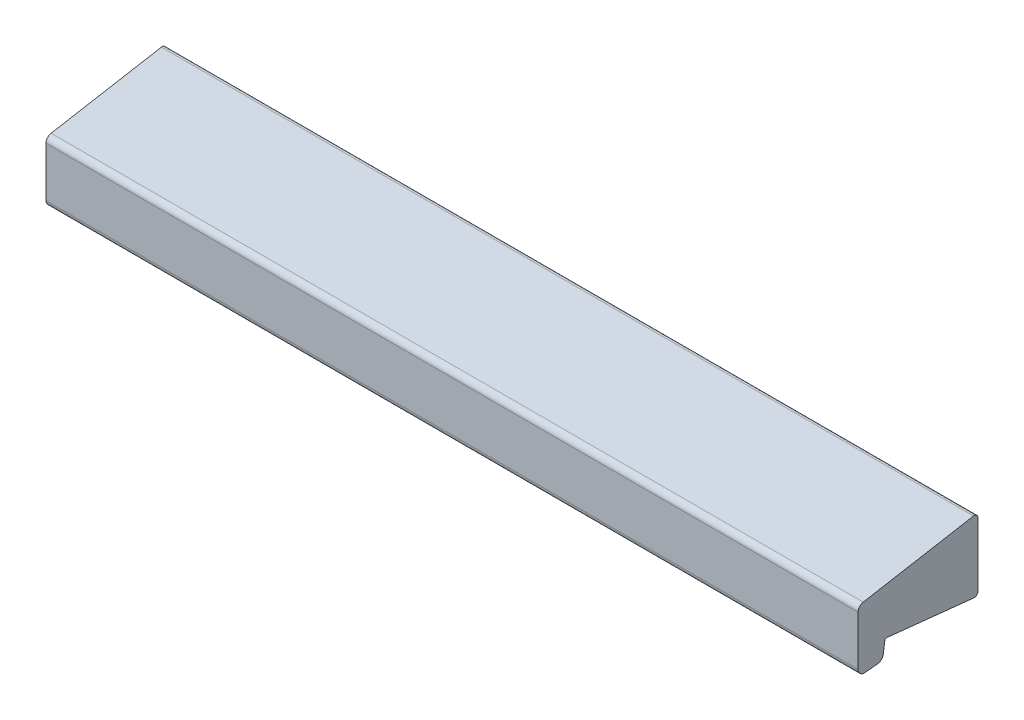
ISO-10303-21;
HEADER;
FILE_DESCRIPTION(('STEP AP214'),'2;1');
FILE_NAME('part.step','',(''),(''),'','','');
FILE_SCHEMA(('AUTOMOTIVE_DESIGN { 1 0 10303 214 1 1 1 1 }'));
ENDSEC;
DATA;
#1=APPLICATION_CONTEXT('core data for automotive mechanical design processes');
#2=APPLICATION_PROTOCOL_DEFINITION('international standard','automotive_design',2000,#1);
#3=PRODUCT_CONTEXT('',#1,'mechanical');
#4=PRODUCT('Part','Part','',(#3));
#5=PRODUCT_RELATED_PRODUCT_CATEGORY('part','',(#4));
#6=PRODUCT_DEFINITION_FORMATION('','',#4);
#7=PRODUCT_DEFINITION_CONTEXT('part definition',#1,'design');
#8=PRODUCT_DEFINITION('design','',#6,#7);
#9=PRODUCT_DEFINITION_SHAPE('','',#8);
#10=(LENGTH_UNIT() NAMED_UNIT(*) SI_UNIT(.MILLI.,.METRE.));
#11=(NAMED_UNIT(*) PLANE_ANGLE_UNIT() SI_UNIT($,.RADIAN.));
#12=(NAMED_UNIT(*) SI_UNIT($,.STERADIAN.) SOLID_ANGLE_UNIT());
#13=UNCERTAINTY_MEASURE_WITH_UNIT(LENGTH_MEASURE(1.E-05),#10,'distance_accuracy_value','');
#14=(GEOMETRIC_REPRESENTATION_CONTEXT(3) GLOBAL_UNCERTAINTY_ASSIGNED_CONTEXT((#13)) GLOBAL_UNIT_ASSIGNED_CONTEXT((#10,
#11,#12)) REPRESENTATION_CONTEXT('',''));
#15=CARTESIAN_POINT('',(0.,0.,0.));
#16=DIRECTION('',(0.,0.,1.));
#17=DIRECTION('',(1.,0.,0.));
#18=AXIS2_PLACEMENT_3D('',#15,#16,#17);
#19=CARTESIAN_POINT('',(-7.5,-4.1,0.5));
#20=DIRECTION('',(1.,0.,0.));
#21=DIRECTION('',(0.,0.,-1.));
#22=AXIS2_PLACEMENT_3D('',#19,#20,#21);
#23=CYLINDRICAL_SURFACE('',#22,0.5);
#24=DIRECTION('',(1.,0.,0.));
#25=VECTOR('',#24,1.);
#26=CARTESIAN_POINT('',(-7.5,-4.1,0.));
#27=LINE('',#26,#25);
#28=CARTESIAN_POINT('',(-7.5,-4.1,0.));
#29=VERTEX_POINT('',#28);
#30=CARTESIAN_POINT('',(97.5,-4.1,0.));
#31=VERTEX_POINT('',#30);
#32=EDGE_CURVE('E17',#29,#31,#27,.T.);
#33=ORIENTED_EDGE('',*,*,#32,.T.);
#34=CARTESIAN_POINT('',(97.5,-4.1,0.5));
#35=DIRECTION('',(1.,0.,0.));
#36=DIRECTION('',(0.,0.,-1.));
#37=AXIS2_PLACEMENT_3D('',#34,#35,#36);
#38=CIRCLE('',#37,0.5);
#39=CARTESIAN_POINT('',(97.5,-4.59726094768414,0.552264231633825));
#40=VERTEX_POINT('',#39);
#41=EDGE_CURVE('E102',#40,#31,#38,.T.);
#42=ORIENTED_EDGE('',*,*,#41,.F.);
#43=DIRECTION('',(1.,0.,0.));
#44=VECTOR('',#43,1.);
#45=CARTESIAN_POINT('',(-7.5,-4.59726094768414,0.552264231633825));
#46=LINE('',#45,#44);
#47=CARTESIAN_POINT('',(-7.5,-4.59726094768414,0.552264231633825));
#48=VERTEX_POINT('',#47);
#49=EDGE_CURVE('E9',#48,#40,#46,.T.);
#50=ORIENTED_EDGE('',*,*,#49,.F.);
#51=CARTESIAN_POINT('',(-7.5,-4.1,0.5));
#52=DIRECTION('',(1.,0.,0.));
#53=DIRECTION('',(0.,0.,1.));
#54=AXIS2_PLACEMENT_3D('',#51,#52,#53);
#55=CIRCLE('',#54,0.5);
#56=EDGE_CURVE('E103',#48,#29,#55,.T.);
#57=ORIENTED_EDGE('',*,*,#56,.T.);
#58=EDGE_LOOP('',(#33,#42,#50,#57));
#59=FACE_BOUND('',#58,.T.);
#60=ADVANCED_FACE('F14',(#59),#23,.T.);
#61=CARTESIAN_POINT('',(-7.5,-4.59726094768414,0.552264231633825));
#62=DIRECTION('',(0.,-0.994521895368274,0.10452846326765));
#63=DIRECTION('',(0.,-0.10452846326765,-0.994521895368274));
#64=AXIS2_PLACEMENT_3D('',#61,#62,#63);
#65=PLANE('',#64);
#66=ORIENTED_EDGE('',*,*,#49,.T.);
#67=DIRECTION('',(0.,-0.10452846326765,-0.994521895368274));
#68=VECTOR('',#67,1.);
#69=CARTESIAN_POINT('',(97.5,-3.41281418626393,11.8215223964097));
#70=LINE('',#69,#68);
#71=CARTESIAN_POINT('',(97.5,-3.41281418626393,11.8215223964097));
#72=VERTEX_POINT('',#71);
#73=EDGE_CURVE('E120',#72,#40,#70,.T.);
#74=ORIENTED_EDGE('',*,*,#73,.F.);
#75=DIRECTION('',(1.,0.,0.));
#76=VECTOR('',#75,1.);
#77=CARTESIAN_POINT('',(-7.5,-3.41281418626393,11.8215223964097));
#78=LINE('',#77,#76);
#79=CARTESIAN_POINT('',(-7.5,-3.41281418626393,11.8215223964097));
#80=VERTEX_POINT('',#79);
#81=EDGE_CURVE('E22',#80,#72,#78,.T.);
#82=ORIENTED_EDGE('',*,*,#81,.F.);
#83=DIRECTION('',(0.,-0.10452846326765,-0.994521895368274));
#84=VECTOR('',#83,1.);
#85=CARTESIAN_POINT('',(-7.5,-4.59726094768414,0.552264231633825));
#86=LINE('',#85,#84);
#87=EDGE_CURVE('E108',#80,#48,#86,.T.);
#88=ORIENTED_EDGE('',*,*,#87,.T.);
#89=EDGE_LOOP('',(#66,#74,#82,#88));
#90=FACE_BOUND('',#89,.T.);
#91=ADVANCED_FACE('F239',(#90),#65,.T.);
#92=CARTESIAN_POINT('',(-7.5,-3.61171856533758,11.8424280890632));
#93=DIRECTION('',(1.,0.,0.));
#94=DIRECTION('',(0.,0.,-1.));
#95=AXIS2_PLACEMENT_3D('',#92,#93,#94);
#96=CYLINDRICAL_SURFACE('',#95,0.2);
#97=ORIENTED_EDGE('',*,*,#81,.T.);
#98=CARTESIAN_POINT('',(97.5,-3.61171856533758,11.8424280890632));
#99=DIRECTION('',(-1.,0.,0.));
#100=DIRECTION('',(0.,0.,-1.));
#101=AXIS2_PLACEMENT_3D('',#98,#99,#100);
#102=CIRCLE('',#101,0.199999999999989);
#103=CARTESIAN_POINT('',(97.5,-3.58388394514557,12.0404817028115));
#104=VERTEX_POINT('',#103);
#105=EDGE_CURVE('E152',#104,#72,#102,.T.);
#106=ORIENTED_EDGE('',*,*,#105,.F.);
#107=DIRECTION('',(1.,0.,0.));
#108=VECTOR('',#107,1.);
#109=CARTESIAN_POINT('',(-7.5,-3.58388394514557,12.0404817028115));
#110=LINE('',#109,#108);
#111=CARTESIAN_POINT('',(-7.5,-3.58388394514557,12.0404817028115));
#112=VERTEX_POINT('',#111);
#113=EDGE_CURVE('E186',#112,#104,#110,.T.);
#114=ORIENTED_EDGE('',*,*,#113,.F.);
#115=CARTESIAN_POINT('',(-7.5,-3.61171856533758,11.8424280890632));
#116=DIRECTION('',(-1.,0.,0.));
#117=DIRECTION('',(0.,0.,1.));
#118=AXIS2_PLACEMENT_3D('',#115,#116,#117);
#119=CIRCLE('',#118,0.2);
#120=EDGE_CURVE('E182',#112,#80,#119,.T.);
#121=ORIENTED_EDGE('',*,*,#120,.T.);
#122=EDGE_LOOP('',(#97,#106,#114,#121));
#123=FACE_BOUND('',#122,.T.);
#124=ADVANCED_FACE('F237',(#123),#96,.F.);
#125=CARTESIAN_POINT('',(-7.5,-3.58388394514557,12.0404817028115));
#126=DIRECTION('',(0.,-0.139173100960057,-0.990268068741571));
#127=DIRECTION('',(0.,0.990268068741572,-0.139173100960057));
#128=AXIS2_PLACEMENT_3D('',#125,#126,#127);
#129=PLANE('',#128);
#130=ORIENTED_EDGE('',*,*,#113,.T.);
#131=DIRECTION('',(0.,0.99026806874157,-0.139173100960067));
#132=VECTOR('',#131,1.);
#133=CARTESIAN_POINT('',(97.5,-5.0807720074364,12.2508556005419));
#134=LINE('',#133,#132);
#135=CARTESIAN_POINT('',(97.5,-5.0807720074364,12.2508556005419));
#136=VERTEX_POINT('',#135);
#137=EDGE_CURVE('E149',#136,#104,#134,.T.);
#138=ORIENTED_EDGE('',*,*,#137,.F.);
#139=DIRECTION('',(1.,0.,0.));
#140=VECTOR('',#139,1.);
#141=CARTESIAN_POINT('',(-7.5,-5.0807720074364,12.2508556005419));
#142=LINE('',#141,#140);
#143=CARTESIAN_POINT('',(-7.5,-5.0807720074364,12.2508556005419));
#144=VERTEX_POINT('',#143);
#145=EDGE_CURVE('E188',#144,#136,#142,.T.);
#146=ORIENTED_EDGE('',*,*,#145,.F.);
#147=DIRECTION('',(0.,0.990268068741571,-0.139173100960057));
#148=VECTOR('',#147,1.);
#149=CARTESIAN_POINT('',(-7.5,-3.58388394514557,12.0404817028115));
#150=LINE('',#149,#148);
#151=EDGE_CURVE('E179',#144,#112,#150,.T.);
#152=ORIENTED_EDGE('',*,*,#151,.T.);
#153=EDGE_LOOP('',(#130,#138,#146,#152));
#154=FACE_BOUND('',#153,.T.);
#155=ADVANCED_FACE('F235',(#154),#129,.T.);
#156=CARTESIAN_POINT('',(-7.5,-4.96943352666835,13.0430700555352));
#157=DIRECTION('',(1.,0.,0.));
#158=DIRECTION('',(0.,0.,-1.));
#159=AXIS2_PLACEMENT_3D('',#156,#157,#158);
#160=CYLINDRICAL_SURFACE('',#159,0.8);
#161=ORIENTED_EDGE('',*,*,#145,.T.);
#162=CARTESIAN_POINT('',(97.5,-4.96943352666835,13.0430700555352));
#163=DIRECTION('',(1.,0.,0.));
#164=DIRECTION('',(0.,0.,-1.));
#165=AXIS2_PLACEMENT_3D('',#162,#163,#164);
#166=CIRCLE('',#165,0.8);
#167=CARTESIAN_POINT('',(97.5,-5.76597138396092,12.9687232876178));
#168=VERTEX_POINT('',#167);
#169=EDGE_CURVE('E146',#168,#136,#166,.T.);
#170=ORIENTED_EDGE('',*,*,#169,.F.);
#171=DIRECTION('',(1.,0.,0.));
#172=VECTOR('',#171,1.);
#173=CARTESIAN_POINT('',(-7.5,-5.76597138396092,12.9687232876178));
#174=LINE('',#173,#172);
#175=CARTESIAN_POINT('',(-7.5,-5.76597138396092,12.9687232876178));
#176=VERTEX_POINT('',#175);
#177=EDGE_CURVE('E190',#176,#168,#174,.T.);
#178=ORIENTED_EDGE('',*,*,#177,.F.);
#179=CARTESIAN_POINT('',(-7.5,-4.96943352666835,13.0430700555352));
#180=DIRECTION('',(1.,0.,0.));
#181=DIRECTION('',(0.,0.,1.));
#182=AXIS2_PLACEMENT_3D('',#179,#180,#181);
#183=CIRCLE('',#182,0.8);
#184=EDGE_CURVE('E176',#176,#144,#183,.T.);
#185=ORIENTED_EDGE('',*,*,#184,.T.);
#186=EDGE_LOOP('',(#161,#170,#178,#185));
#187=FACE_BOUND('',#186,.T.);
#188=ADVANCED_FACE('F230',(#187),#160,.T.);
#189=CARTESIAN_POINT('',(-7.5,-5.76597138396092,12.9687232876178));
#190=DIRECTION('',(0.,-0.995672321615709,-0.0929334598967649));
#191=DIRECTION('',(0.,0.0929334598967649,-0.995672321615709));
#192=AXIS2_PLACEMENT_3D('',#189,#190,#191);
#193=PLANE('',#192);
#194=ORIENTED_EDGE('',*,*,#177,.T.);
#195=DIRECTION('',(0.,0.0929334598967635,-0.995672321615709));
#196=VECTOR('',#195,1.);
#197=CARTESIAN_POINT('',(97.5,-5.92062490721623,14.6256532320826));
#198=LINE('',#197,#196);
#199=CARTESIAN_POINT('',(97.5,-5.92062490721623,14.6256532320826));
#200=VERTEX_POINT('',#199);
#201=EDGE_CURVE('E143',#200,#168,#198,.T.);
#202=ORIENTED_EDGE('',*,*,#201,.F.);
#203=DIRECTION('',(1.,0.,0.));
#204=VECTOR('',#203,1.);
#205=CARTESIAN_POINT('',(-7.5,-5.92062490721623,14.6256532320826));
#206=LINE('',#205,#204);
#207=CARTESIAN_POINT('',(-7.5,-5.92062490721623,14.6256532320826));
#208=VERTEX_POINT('',#207);
#209=EDGE_CURVE('E192',#208,#200,#206,.T.);
#210=ORIENTED_EDGE('',*,*,#209,.F.);
#211=DIRECTION('',(0.,0.0929334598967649,-0.995672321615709));
#212=VECTOR('',#211,1.);
#213=CARTESIAN_POINT('',(-7.5,-5.76597138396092,12.9687232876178));
#214=LINE('',#213,#212);
#215=EDGE_CURVE('E173',#208,#176,#214,.T.);
#216=ORIENTED_EDGE('',*,*,#215,.T.);
#217=EDGE_LOOP('',(#194,#202,#210,#216));
#218=FACE_BOUND('',#217,.T.);
#219=ADVANCED_FACE('F225',(#218),#193,.T.);
#220=CARTESIAN_POINT('',(-7.5,-5.12408704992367,14.7));
#221=DIRECTION('',(1.,0.,0.));
#222=DIRECTION('',(0.,0.,-1.));
#223=AXIS2_PLACEMENT_3D('',#220,#221,#222);
#224=CYLINDRICAL_SURFACE('',#223,0.8);
#225=ORIENTED_EDGE('',*,*,#209,.T.);
#226=CARTESIAN_POINT('',(97.5,-5.12408704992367,14.7));
#227=DIRECTION('',(1.,0.,0.));
#228=DIRECTION('',(0.,0.,-1.));
#229=AXIS2_PLACEMENT_3D('',#226,#227,#228);
#230=CIRCLE('',#229,0.8);
#231=CARTESIAN_POINT('',(97.5,-5.12408704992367,15.5));
#232=VERTEX_POINT('',#231);
#233=EDGE_CURVE('E140',#232,#200,#230,.T.);
#234=ORIENTED_EDGE('',*,*,#233,.F.);
#235=DIRECTION('',(1.,0.,0.));
#236=VECTOR('',#235,1.);
#237=CARTESIAN_POINT('',(-7.5,-5.12408704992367,15.5));
#238=LINE('',#237,#236);
#239=CARTESIAN_POINT('',(-7.5,-5.12408704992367,15.5));
#240=VERTEX_POINT('',#239);
#241=EDGE_CURVE('E194',#240,#232,#238,.T.);
#242=ORIENTED_EDGE('',*,*,#241,.F.);
#243=CARTESIAN_POINT('',(-7.5,-5.12408704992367,14.7));
#244=DIRECTION('',(1.,0.,0.));
#245=DIRECTION('',(0.,0.,-1.));
#246=AXIS2_PLACEMENT_3D('',#243,#244,#245);
#247=CIRCLE('',#246,0.8);
#248=EDGE_CURVE('E170',#240,#208,#247,.T.);
#249=ORIENTED_EDGE('',*,*,#248,.T.);
#250=EDGE_LOOP('',(#225,#234,#242,#249));
#251=FACE_BOUND('',#250,.T.);
#252=ADVANCED_FACE('F223',(#251),#224,.T.);
#253=CARTESIAN_POINT('',(-7.5,-5.12408704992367,15.5));
#254=DIRECTION('',(0.,0.,1.));
#255=DIRECTION('',(0.,-1.,0.));
#256=AXIS2_PLACEMENT_3D('',#253,#254,#255);
#257=PLANE('',#256);
#258=ORIENTED_EDGE('',*,*,#241,.T.);
#259=DIRECTION('',(0.,-1.,0.));
#260=VECTOR('',#259,1.);
#261=CARTESIAN_POINT('',(97.5,1.291528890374,15.5));
#262=LINE('',#261,#260);
#263=CARTESIAN_POINT('',(97.5,1.291528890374,15.5));
#264=VERTEX_POINT('',#263);
#265=EDGE_CURVE('E137',#264,#232,#262,.T.);
#266=ORIENTED_EDGE('',*,*,#265,.F.);
#267=DIRECTION('',(1.,0.,0.));
#268=VECTOR('',#267,1.);
#269=CARTESIAN_POINT('',(-7.5,1.291528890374,15.5));
#270=LINE('',#269,#268);
#271=CARTESIAN_POINT('',(-7.5,1.291528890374,15.5));
#272=VERTEX_POINT('',#271);
#273=EDGE_CURVE('E196',#272,#264,#270,.T.);
#274=ORIENTED_EDGE('',*,*,#273,.F.);
#275=DIRECTION('',(0.,-1.,0.));
#276=VECTOR('',#275,1.);
#277=CARTESIAN_POINT('',(-7.5,-5.12408704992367,15.5));
#278=LINE('',#277,#276);
#279=EDGE_CURVE('E167',#272,#240,#278,.T.);
#280=ORIENTED_EDGE('',*,*,#279,.T.);
#281=EDGE_LOOP('',(#258,#266,#274,#280));
#282=FACE_BOUND('',#281,.T.);
#283=ADVANCED_FACE('F218',(#282),#257,.T.);
#284=CARTESIAN_POINT('',(-7.5,1.291528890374,14.7));
#285=DIRECTION('',(1.,0.,0.));
#286=DIRECTION('',(0.,0.,-1.));
#287=AXIS2_PLACEMENT_3D('',#284,#285,#286);
#288=CYLINDRICAL_SURFACE('',#287,0.8);
#289=ORIENTED_EDGE('',*,*,#273,.T.);
#290=CARTESIAN_POINT('',(97.5,1.291528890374,14.7));
#291=DIRECTION('',(1.,0.,0.));
#292=DIRECTION('',(0.,0.,-1.));
#293=AXIS2_PLACEMENT_3D('',#290,#291,#292);
#294=CIRCLE('',#293,0.8);
#295=CARTESIAN_POINT('',(97.5,2.07937509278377,14.8389185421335));
#296=VERTEX_POINT('',#295);
#297=EDGE_CURVE('E134',#296,#264,#294,.T.);
#298=ORIENTED_EDGE('',*,*,#297,.F.);
#299=DIRECTION('',(1.,0.,0.));
#300=VECTOR('',#299,1.);
#301=CARTESIAN_POINT('',(-7.5,2.07937509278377,14.8389185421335));
#302=LINE('',#301,#300);
#303=CARTESIAN_POINT('',(-7.5,2.07937509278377,14.8389185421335));
#304=VERTEX_POINT('',#303);
#305=EDGE_CURVE('E198',#304,#296,#302,.T.);
#306=ORIENTED_EDGE('',*,*,#305,.F.);
#307=CARTESIAN_POINT('',(-7.5,1.291528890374,14.7));
#308=DIRECTION('',(1.,0.,0.));
#309=DIRECTION('',(0.,0.,1.));
#310=AXIS2_PLACEMENT_3D('',#307,#308,#309);
#311=CIRCLE('',#310,0.8);
#312=EDGE_CURVE('E164',#304,#272,#311,.T.);
#313=ORIENTED_EDGE('',*,*,#312,.T.);
#314=EDGE_LOOP('',(#289,#298,#306,#313));
#315=FACE_BOUND('',#314,.T.);
#316=ADVANCED_FACE('F211',(#315),#288,.T.);
#317=CARTESIAN_POINT('',(-7.5,4.5924038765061,0.586824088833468));
#318=DIRECTION('',(0.,0.984807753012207,0.173648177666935));
#319=DIRECTION('',(0.,-0.173648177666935,0.984807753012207));
#320=AXIS2_PLACEMENT_3D('',#317,#318,#319);
#321=PLANE('',#320);
#322=ORIENTED_EDGE('',*,*,#305,.T.);
#323=DIRECTION('',(0.,-0.173648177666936,0.984807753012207));
#324=VECTOR('',#323,1.);
#325=CARTESIAN_POINT('',(97.5,4.5924038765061,0.586824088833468));
#326=LINE('',#325,#324);
#327=CARTESIAN_POINT('',(97.5,4.5924038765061,0.586824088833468));
#328=VERTEX_POINT('',#327);
#329=EDGE_CURVE('E131',#328,#296,#326,.T.);
#330=ORIENTED_EDGE('',*,*,#329,.F.);
#331=DIRECTION('',(1.,0.,0.));
#332=VECTOR('',#331,1.);
#333=CARTESIAN_POINT('',(-7.5,4.5924038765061,0.586824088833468));
#334=LINE('',#333,#332);
#335=CARTESIAN_POINT('',(-7.5,4.5924038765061,0.586824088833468));
#336=VERTEX_POINT('',#335);
#337=EDGE_CURVE('E200',#336,#328,#334,.T.);
#338=ORIENTED_EDGE('',*,*,#337,.F.);
#339=DIRECTION('',(0.,-0.173648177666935,0.984807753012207));
#340=VECTOR('',#339,1.);
#341=CARTESIAN_POINT('',(-7.5,4.5924038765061,0.586824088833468));
#342=LINE('',#341,#340);
#343=EDGE_CURVE('E161',#336,#304,#342,.T.);
#344=ORIENTED_EDGE('',*,*,#343,.T.);
#345=EDGE_LOOP('',(#322,#330,#338,#344));
#346=FACE_BOUND('',#345,.T.);
#347=ADVANCED_FACE('F208',(#346),#321,.T.);
#348=CARTESIAN_POINT('',(-7.5,4.1,0.5));
#349=DIRECTION('',(1.,0.,0.));
#350=DIRECTION('',(0.,0.,-1.));
#351=AXIS2_PLACEMENT_3D('',#348,#349,#350);
#352=CYLINDRICAL_SURFACE('',#351,0.5);
#353=ORIENTED_EDGE('',*,*,#337,.T.);
#354=CARTESIAN_POINT('',(97.5,4.1,0.5));
#355=DIRECTION('',(1.,0.,0.));
#356=DIRECTION('',(0.,0.,-1.));
#357=AXIS2_PLACEMENT_3D('',#354,#355,#356);
#358=CIRCLE('',#357,0.5);
#359=CARTESIAN_POINT('',(97.5,4.1,0.));
#360=VERTEX_POINT('',#359);
#361=EDGE_CURVE('E115',#360,#328,#358,.T.);
#362=ORIENTED_EDGE('',*,*,#361,.F.);
#363=DIRECTION('',(1.,0.,0.));
#364=VECTOR('',#363,1.);
#365=CARTESIAN_POINT('',(-7.5,4.1,0.));
#366=LINE('',#365,#364);
#367=CARTESIAN_POINT('',(-7.5,4.1,0.));
#368=VERTEX_POINT('',#367);
#369=EDGE_CURVE('E107',#368,#360,#366,.T.);
#370=ORIENTED_EDGE('',*,*,#369,.F.);
#371=CARTESIAN_POINT('',(-7.5,4.1,0.5));
#372=DIRECTION('',(1.,0.,0.));
#373=DIRECTION('',(0.,0.,1.));
#374=AXIS2_PLACEMENT_3D('',#371,#372,#373);
#375=CIRCLE('',#374,0.5);
#376=EDGE_CURVE('E158',#368,#336,#375,.T.);
#377=ORIENTED_EDGE('',*,*,#376,.T.);
#378=EDGE_LOOP('',(#353,#362,#370,#377));
#379=FACE_BOUND('',#378,.T.);
#380=ADVANCED_FACE('F202',(#379),#352,.T.);
#381=CARTESIAN_POINT('',(-7.5,-4.1,0.));
#382=DIRECTION('',(0.,0.,-1.));
#383=DIRECTION('',(-1.,0.,0.));
#384=AXIS2_PLACEMENT_3D('',#381,#382,#383);
#385=PLANE('',#384);
#386=CARTESIAN_POINT('',(0.,0.,0.));
#387=DIRECTION('',(0.,0.,-1.));
#388=DIRECTION('',(-1.,0.,0.));
#389=AXIS2_PLACEMENT_3D('',#386,#387,#388);
#390=CIRCLE('',#389,2.);
#391=CARTESIAN_POINT('',(-2.,0.,0.));
#392=VERTEX_POINT('',#391);
#393=EDGE_CURVE('E124',#392,#392,#390,.T.);
#394=ORIENTED_EDGE('',*,*,#393,.F.);
#395=EDGE_LOOP('',(#394));
#396=FACE_BOUND('',#395,.T.);
#397=CARTESIAN_POINT('',(90.,0.,0.));
#398=DIRECTION('',(0.,0.,-1.));
#399=DIRECTION('',(-1.,0.,0.));
#400=AXIS2_PLACEMENT_3D('',#397,#398,#399);
#401=CIRCLE('',#400,2.);
#402=CARTESIAN_POINT('',(88.,0.,0.));
#403=VERTEX_POINT('',#402);
#404=EDGE_CURVE('E127',#403,#403,#401,.T.);
#405=ORIENTED_EDGE('',*,*,#404,.F.);
#406=EDGE_LOOP('',(#405));
#407=FACE_BOUND('',#406,.T.);
#408=ORIENTED_EDGE('',*,*,#369,.T.);
#409=DIRECTION('',(0.,1.,0.));
#410=VECTOR('',#409,1.);
#411=CARTESIAN_POINT('',(97.5,-4.1,0.));
#412=LINE('',#411,#410);
#413=EDGE_CURVE('E110',#31,#360,#412,.T.);
#414=ORIENTED_EDGE('',*,*,#413,.F.);
#415=ORIENTED_EDGE('',*,*,#32,.F.);
#416=DIRECTION('',(0.,1.,0.));
#417=VECTOR('',#416,1.);
#418=CARTESIAN_POINT('',(-7.5,-4.1,0.));
#419=LINE('',#418,#417);
#420=EDGE_CURVE('E156',#29,#368,#419,.T.);
#421=ORIENTED_EDGE('',*,*,#420,.T.);
#422=EDGE_LOOP('',(#408,#414,#415,#421));
#423=FACE_BOUND('',#422,.T.);
#424=ADVANCED_FACE('F111',(#396,#407,#423),#385,.T.);
#425=CARTESIAN_POINT('',(-7.5,-4.1,0.5));
#426=DIRECTION('',(-1.,0.,0.));
#427=DIRECTION('',(0.,0.,1.));
#428=AXIS2_PLACEMENT_3D('',#425,#426,#427);
#429=PLANE('',#428);
#430=ORIENTED_EDGE('',*,*,#56,.F.);
#431=ORIENTED_EDGE('',*,*,#87,.F.);
#432=ORIENTED_EDGE('',*,*,#120,.F.);
#433=ORIENTED_EDGE('',*,*,#151,.F.);
#434=ORIENTED_EDGE('',*,*,#184,.F.);
#435=ORIENTED_EDGE('',*,*,#215,.F.);
#436=ORIENTED_EDGE('',*,*,#248,.F.);
#437=ORIENTED_EDGE('',*,*,#279,.F.);
#438=ORIENTED_EDGE('',*,*,#312,.F.);
#439=ORIENTED_EDGE('',*,*,#343,.F.);
#440=ORIENTED_EDGE('',*,*,#376,.F.);
#441=ORIENTED_EDGE('',*,*,#420,.F.);
#442=EDGE_LOOP('',(#430,#431,#432,#433,#434,#435,#436,#437,#438,#439,#440,#441));
#443=FACE_BOUND('',#442,.T.);
#444=ADVANCED_FACE('F214',(#443),#429,.T.);
#445=CARTESIAN_POINT('',(97.5,-4.1,0.5));
#446=DIRECTION('',(1.,0.,0.));
#447=DIRECTION('',(0.,0.,-1.));
#448=AXIS2_PLACEMENT_3D('',#445,#446,#447);
#449=PLANE('',#448);
#450=ORIENTED_EDGE('',*,*,#41,.T.);
#451=ORIENTED_EDGE('',*,*,#413,.T.);
#452=ORIENTED_EDGE('',*,*,#361,.T.);
#453=ORIENTED_EDGE('',*,*,#329,.T.);
#454=ORIENTED_EDGE('',*,*,#297,.T.);
#455=ORIENTED_EDGE('',*,*,#265,.T.);
#456=ORIENTED_EDGE('',*,*,#233,.T.);
#457=ORIENTED_EDGE('',*,*,#201,.T.);
#458=ORIENTED_EDGE('',*,*,#169,.T.);
#459=ORIENTED_EDGE('',*,*,#137,.T.);
#460=ORIENTED_EDGE('',*,*,#105,.T.);
#461=ORIENTED_EDGE('',*,*,#73,.T.);
#462=EDGE_LOOP('',(#450,#451,#452,#453,#454,#455,#456,#457,#458,#459,#460,#461));
#463=FACE_BOUND('',#462,.T.);
#464=ADVANCED_FACE('F118',(#463),#449,.T.);
#465=CARTESIAN_POINT('',(90.,0.,8.));
#466=DIRECTION('',(0.,0.,-1.));
#467=DIRECTION('',(-1.,0.,0.));
#468=AXIS2_PLACEMENT_3D('',#465,#466,#467);
#469=CYLINDRICAL_SURFACE('',#468,2.);
#470=CARTESIAN_POINT('',(90.,0.,8.));
#471=DIRECTION('',(0.,0.,-1.));
#472=DIRECTION('',(-1.,0.,0.));
#473=AXIS2_PLACEMENT_3D('',#470,#471,#472);
#474=CIRCLE('',#473,2.);
#475=CARTESIAN_POINT('',(88.,0.,8.));
#476=VERTEX_POINT('',#475);
#477=EDGE_CURVE('E279',#476,#476,#474,.T.);
#478=ORIENTED_EDGE('',*,*,#477,.F.);
#479=EDGE_LOOP('',(#478));
#480=FACE_BOUND('',#479,.T.);
#481=ORIENTED_EDGE('',*,*,#404,.T.);
#482=EDGE_LOOP('',(#481));
#483=FACE_BOUND('',#482,.T.);
#484=ADVANCED_FACE('F298',(#480,#483),#469,.F.);
#485=CARTESIAN_POINT('',(90.,0.,8.));
#486=DIRECTION('',(0.,0.,-1.));
#487=DIRECTION('',(-1.,0.,0.));
#488=AXIS2_PLACEMENT_3D('',#485,#486,#487);
#489=PLANE('',#488);
#490=ORIENTED_EDGE('',*,*,#477,.T.);
#491=EDGE_LOOP('',(#490));
#492=FACE_BOUND('',#491,.T.);
#493=ADVANCED_FACE('F288',(#492),#489,.T.);
#494=CARTESIAN_POINT('',(0.,0.,8.));
#495=DIRECTION('',(0.,0.,-1.));
#496=DIRECTION('',(-1.,0.,0.));
#497=AXIS2_PLACEMENT_3D('',#494,#495,#496);
#498=CYLINDRICAL_SURFACE('',#497,2.);
#499=CARTESIAN_POINT('',(0.,0.,8.));
#500=DIRECTION('',(0.,0.,-1.));
#501=DIRECTION('',(-1.,0.,0.));
#502=AXIS2_PLACEMENT_3D('',#499,#500,#501);
#503=CIRCLE('',#502,2.);
#504=CARTESIAN_POINT('',(-2.,0.,8.));
#505=VERTEX_POINT('',#504);
#506=EDGE_CURVE('E121',#505,#505,#503,.T.);
#507=ORIENTED_EDGE('',*,*,#506,.F.);
#508=EDGE_LOOP('',(#507));
#509=FACE_BOUND('',#508,.T.);
#510=ORIENTED_EDGE('',*,*,#393,.T.);
#511=EDGE_LOOP('',(#510));
#512=FACE_BOUND('',#511,.T.);
#513=ADVANCED_FACE('F285',(#509,#512),#498,.F.);
#514=CARTESIAN_POINT('',(0.,0.,8.));
#515=DIRECTION('',(0.,0.,-1.));
#516=DIRECTION('',(-1.,0.,0.));
#517=AXIS2_PLACEMENT_3D('',#514,#515,#516);
#518=PLANE('',#517);
#519=ORIENTED_EDGE('',*,*,#506,.T.);
#520=EDGE_LOOP('',(#519));
#521=FACE_BOUND('',#520,.T.);
#522=ADVANCED_FACE('F287',(#521),#518,.T.);
#523=CLOSED_SHELL('',(#60,#91,#124,#155,#188,#219,#252,#283,#316,#347,#380,#424,#444,#464,#484,
#493,#513,#522));
#524=MANIFOLD_SOLID_BREP('B1',#523);
#525=ADVANCED_BREP_SHAPE_REPRESENTATION('',(#18,#524),#14);
#526=SHAPE_DEFINITION_REPRESENTATION(#9,#525);
ENDSEC;
END-ISO-10303-21;
